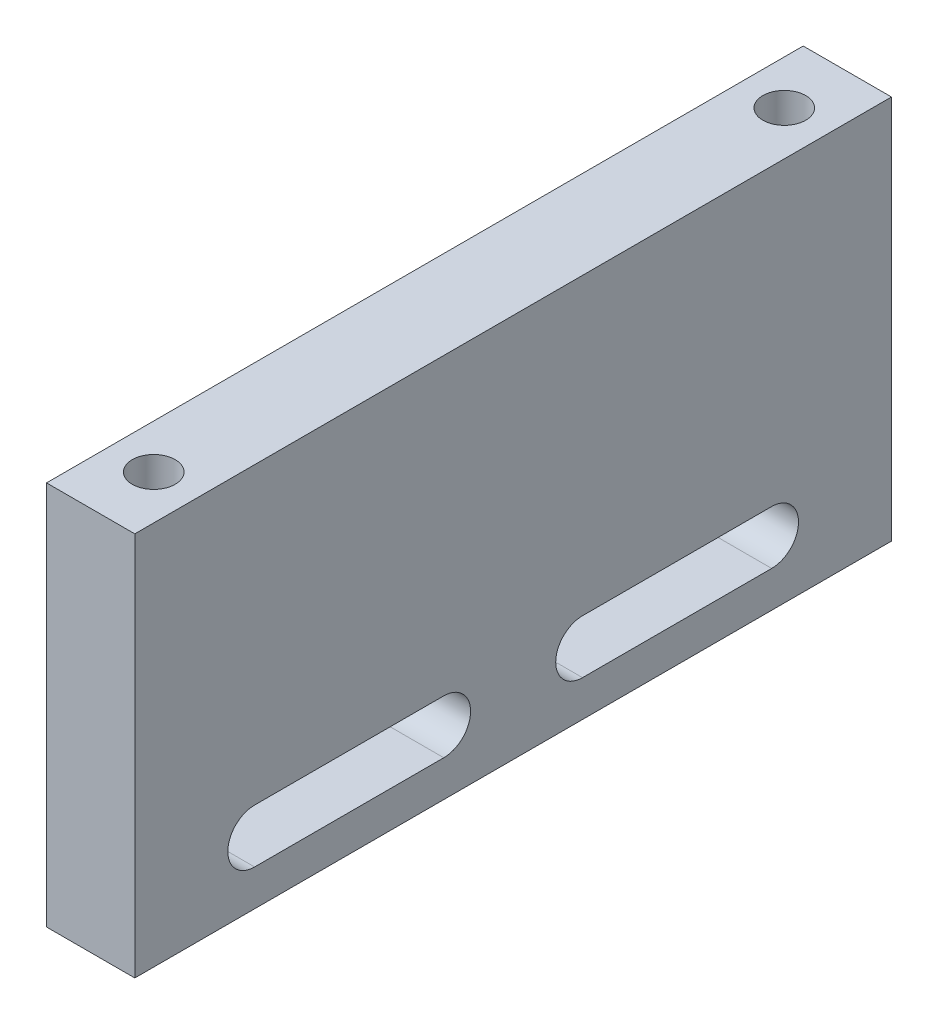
ISO-10303-21;
HEADER;
FILE_DESCRIPTION(('STEP AP214'),'2;1');
FILE_NAME('part.step','',(''),(''),'','','');
FILE_SCHEMA(('AUTOMOTIVE_DESIGN { 1 0 10303 214 1 1 1 1 }'));
ENDSEC;
DATA;
#1=APPLICATION_CONTEXT('core data for automotive mechanical design processes');
#2=APPLICATION_PROTOCOL_DEFINITION('international standard','automotive_design',2000,#1);
#3=PRODUCT_CONTEXT('',#1,'mechanical');
#4=PRODUCT('Part','Part','',(#3));
#5=PRODUCT_RELATED_PRODUCT_CATEGORY('part','',(#4));
#6=PRODUCT_DEFINITION_FORMATION('','',#4);
#7=PRODUCT_DEFINITION_CONTEXT('part definition',#1,'design');
#8=PRODUCT_DEFINITION('design','',#6,#7);
#9=PRODUCT_DEFINITION_SHAPE('','',#8);
#10=(LENGTH_UNIT() NAMED_UNIT(*) SI_UNIT(.MILLI.,.METRE.));
#11=(NAMED_UNIT(*) PLANE_ANGLE_UNIT() SI_UNIT($,.RADIAN.));
#12=(NAMED_UNIT(*) SI_UNIT($,.STERADIAN.) SOLID_ANGLE_UNIT());
#13=UNCERTAINTY_MEASURE_WITH_UNIT(LENGTH_MEASURE(1.E-05),#10,'distance_accuracy_value','');
#14=(GEOMETRIC_REPRESENTATION_CONTEXT(3) GLOBAL_UNCERTAINTY_ASSIGNED_CONTEXT((#13)) GLOBAL_UNIT_ASSIGNED_CONTEXT((#10,
#11,#12)) REPRESENTATION_CONTEXT('',''));
#15=CARTESIAN_POINT('',(0.,0.,0.));
#16=DIRECTION('',(0.,0.,1.));
#17=DIRECTION('',(1.,0.,0.));
#18=AXIS2_PLACEMENT_3D('',#15,#16,#17);
#19=CARTESIAN_POINT('',(0.,41.2499999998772,-50.));
#20=DIRECTION('',(0.,1.,0.));
#21=DIRECTION('',(0.,0.,1.));
#22=AXIS2_PLACEMENT_3D('',#19,#20,#21);
#23=CONICAL_SURFACE('',#22,3.39999999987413,1.02974425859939);
#24=CARTESIAN_POINT('',(0.,39.207073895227,-50.));
#25=VERTEX_POINT('',#24);
#26=VERTEX_LOOP('',#25);
#27=FACE_BOUND('',#26,.T.);
#28=CARTESIAN_POINT('',(0.,41.25,-50.));
#29=DIRECTION('',(0.,1.,0.));
#30=DIRECTION('',(0.,0.,1.));
#31=AXIS2_PLACEMENT_3D('',#28,#29,#30);
#32=CIRCLE('',#31,3.4);
#33=CARTESIAN_POINT('',(0.,41.25,-46.6));
#34=VERTEX_POINT('',#33);
#35=EDGE_CURVE('E149',#34,#34,#32,.T.);
#36=ORIENTED_EDGE('',*,*,#35,.T.);
#37=EDGE_LOOP('',(#36));
#38=FACE_BOUND('',#37,.T.);
#39=ADVANCED_FACE('F17',(#27,#38),#23,.F.);
#40=CARTESIAN_POINT('',(0.,41.2499999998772,50.));
#41=DIRECTION('',(0.,1.,0.));
#42=DIRECTION('',(0.,0.,1.));
#43=AXIS2_PLACEMENT_3D('',#40,#41,#42);
#44=CONICAL_SURFACE('',#43,3.39999999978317,1.02974425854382);
#45=CARTESIAN_POINT('',(0.,39.2070738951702,50.));
#46=VERTEX_POINT('',#45);
#47=VERTEX_LOOP('',#46);
#48=FACE_BOUND('',#47,.T.);
#49=CARTESIAN_POINT('',(0.,41.25,50.));
#50=DIRECTION('',(0.,1.,0.));
#51=DIRECTION('',(0.,0.,1.));
#52=AXIS2_PLACEMENT_3D('',#49,#50,#51);
#53=CIRCLE('',#52,3.4);
#54=CARTESIAN_POINT('',(0.,41.25,53.4));
#55=VERTEX_POINT('',#54);
#56=EDGE_CURVE('E120',#55,#55,#53,.T.);
#57=ORIENTED_EDGE('',*,*,#56,.T.);
#58=EDGE_LOOP('',(#57));
#59=FACE_BOUND('',#58,.T.);
#60=ADVANCED_FACE('F296',(#48,#59),#44,.F.);
#61=CARTESIAN_POINT('',(0.,61.,-50.));
#62=DIRECTION('',(0.,1.,0.));
#63=DIRECTION('',(0.,0.,1.));
#64=AXIS2_PLACEMENT_3D('',#61,#62,#63);
#65=CYLINDRICAL_SURFACE('',#64,3.4);
#66=CARTESIAN_POINT('',(0.,61.,-50.));
#67=DIRECTION('',(0.,1.,0.));
#68=DIRECTION('',(0.,0.,1.));
#69=AXIS2_PLACEMENT_3D('',#66,#67,#68);
#70=CIRCLE('',#69,3.4);
#71=CARTESIAN_POINT('',(0.,61.,-46.6));
#72=VERTEX_POINT('',#71);
#73=EDGE_CURVE('E170',#72,#72,#70,.F.);
#74=ORIENTED_EDGE('',*,*,#73,.F.);
#75=EDGE_LOOP('',(#74));
#76=FACE_BOUND('',#75,.T.);
#77=ORIENTED_EDGE('',*,*,#35,.F.);
#78=EDGE_LOOP('',(#77));
#79=FACE_BOUND('',#78,.T.);
#80=ADVANCED_FACE('F293',(#76,#79),#65,.F.);
#81=CARTESIAN_POINT('',(0.,61.,50.));
#82=DIRECTION('',(0.,1.,0.));
#83=DIRECTION('',(0.,0.,1.));
#84=AXIS2_PLACEMENT_3D('',#81,#82,#83);
#85=CYLINDRICAL_SURFACE('',#84,3.4);
#86=CARTESIAN_POINT('',(0.,61.,50.));
#87=DIRECTION('',(0.,1.,0.));
#88=DIRECTION('',(0.,0.,1.));
#89=AXIS2_PLACEMENT_3D('',#86,#87,#88);
#90=CIRCLE('',#89,3.4);
#91=CARTESIAN_POINT('',(0.,61.,53.4));
#92=VERTEX_POINT('',#91);
#93=EDGE_CURVE('E166',#92,#92,#90,.F.);
#94=ORIENTED_EDGE('',*,*,#93,.F.);
#95=EDGE_LOOP('',(#94));
#96=FACE_BOUND('',#95,.T.);
#97=ORIENTED_EDGE('',*,*,#56,.F.);
#98=EDGE_LOOP('',(#97));
#99=FACE_BOUND('',#98,.T.);
#100=ADVANCED_FACE('F289',(#96,#99),#85,.F.);
#101=CARTESIAN_POINT('',(-7.00000000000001,61.,-60.));
#102=DIRECTION('',(1.,0.,0.));
#103=DIRECTION('',(0.,0.,-1.));
#104=AXIS2_PLACEMENT_3D('',#101,#102,#103);
#105=PLANE('',#104);
#106=DIRECTION('',(0.,1.,0.));
#107=VECTOR('',#106,1.);
#108=CARTESIAN_POINT('',(-6.99999999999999,61.,60.));
#109=LINE('',#108,#107);
#110=CARTESIAN_POINT('',(-7.,0.,60.));
#111=VERTEX_POINT('',#110);
#112=CARTESIAN_POINT('',(-7.,61.,60.));
#113=VERTEX_POINT('',#112);
#114=EDGE_CURVE('E173',#111,#113,#109,.T.);
#115=ORIENTED_EDGE('',*,*,#114,.T.);
#116=DIRECTION('',(0.,0.,1.));
#117=VECTOR('',#116,1.);
#118=CARTESIAN_POINT('',(-7.00000000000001,61.,0.));
#119=LINE('',#118,#117);
#120=CARTESIAN_POINT('',(-7.00000000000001,61.,-60.));
#121=VERTEX_POINT('',#120);
#122=EDGE_CURVE('E169',#121,#113,#119,.T.);
#123=ORIENTED_EDGE('',*,*,#122,.F.);
#124=DIRECTION('',(0.,1.,0.));
#125=VECTOR('',#124,1.);
#126=CARTESIAN_POINT('',(-7.00000000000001,61.,-60.));
#127=LINE('',#126,#125);
#128=CARTESIAN_POINT('',(-7.00000000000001,0.,-60.));
#129=VERTEX_POINT('',#128);
#130=EDGE_CURVE('E200',#121,#129,#127,.F.);
#131=ORIENTED_EDGE('',*,*,#130,.T.);
#132=DIRECTION('',(0.,0.,1.));
#133=VECTOR('',#132,1.);
#134=CARTESIAN_POINT('',(-7.00000000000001,0.,0.));
#135=LINE('',#134,#133);
#136=EDGE_CURVE('E196',#129,#111,#135,.T.);
#137=ORIENTED_EDGE('',*,*,#136,.T.);
#138=EDGE_LOOP('',(#115,#123,#131,#137));
#139=FACE_BOUND('',#138,.T.);
#140=CARTESIAN_POINT('',(-7.00000000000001,10.,41.));
#141=DIRECTION('',(1.,0.,0.));
#142=DIRECTION('',(0.,0.,-1.));
#143=AXIS2_PLACEMENT_3D('',#140,#141,#142);
#144=CIRCLE('',#143,4.25000000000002);
#145=CARTESIAN_POINT('',(-7.00000000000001,14.25,41.));
#146=VERTEX_POINT('',#145);
#147=CARTESIAN_POINT('',(-7.00000000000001,5.74999999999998,41.));
#148=VERTEX_POINT('',#147);
#149=EDGE_CURVE('E174',#146,#148,#144,.T.);
#150=ORIENTED_EDGE('',*,*,#149,.T.);
#151=DIRECTION('',(0.,0.,-1.));
#152=VECTOR('',#151,1.);
#153=CARTESIAN_POINT('',(-7.00000000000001,5.74999999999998,41.));
#154=LINE('',#153,#152);
#155=CARTESIAN_POINT('',(-7.,5.74999999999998,11.));
#156=VERTEX_POINT('',#155);
#157=EDGE_CURVE('E135',#148,#156,#154,.T.);
#158=ORIENTED_EDGE('',*,*,#157,.T.);
#159=CARTESIAN_POINT('',(-7.00000000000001,10.,11.));
#160=DIRECTION('',(1.,0.,0.));
#161=DIRECTION('',(0.,0.,-1.));
#162=AXIS2_PLACEMENT_3D('',#159,#160,#161);
#163=CIRCLE('',#162,4.25000000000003);
#164=CARTESIAN_POINT('',(-7.00000000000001,14.25,11.));
#165=VERTEX_POINT('',#164);
#166=EDGE_CURVE('E176',#156,#165,#163,.T.);
#167=ORIENTED_EDGE('',*,*,#166,.T.);
#168=DIRECTION('',(0.,0.,1.));
#169=VECTOR('',#168,1.);
#170=CARTESIAN_POINT('',(-7.00000000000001,14.25,41.));
#171=LINE('',#170,#169);
#172=EDGE_CURVE('E140',#165,#146,#171,.T.);
#173=ORIENTED_EDGE('',*,*,#172,.T.);
#174=EDGE_LOOP('',(#150,#158,#167,#173));
#175=FACE_BOUND('',#174,.T.);
#176=CARTESIAN_POINT('',(-7.00000000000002,10.,-11.));
#177=DIRECTION('',(1.,0.,0.));
#178=DIRECTION('',(0.,0.,-1.));
#179=AXIS2_PLACEMENT_3D('',#176,#177,#178);
#180=CIRCLE('',#179,4.25000000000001);
#181=CARTESIAN_POINT('',(-7.00000000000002,14.25,-11.));
#182=VERTEX_POINT('',#181);
#183=CARTESIAN_POINT('',(-7.00000000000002,5.74999999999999,-11.));
#184=VERTEX_POINT('',#183);
#185=EDGE_CURVE('E177',#182,#184,#180,.T.);
#186=ORIENTED_EDGE('',*,*,#185,.T.);
#187=DIRECTION('',(0.,0.,-1.));
#188=VECTOR('',#187,1.);
#189=CARTESIAN_POINT('',(-7.00000000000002,5.74999999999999,-11.));
#190=LINE('',#189,#188);
#191=CARTESIAN_POINT('',(-7.00000000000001,5.74999999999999,-41.));
#192=VERTEX_POINT('',#191);
#193=EDGE_CURVE('E114',#184,#192,#190,.T.);
#194=ORIENTED_EDGE('',*,*,#193,.T.);
#195=CARTESIAN_POINT('',(-7.00000000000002,10.,-41.));
#196=DIRECTION('',(1.,0.,0.));
#197=DIRECTION('',(0.,0.,-1.));
#198=AXIS2_PLACEMENT_3D('',#195,#196,#197);
#199=CIRCLE('',#198,4.25000000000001);
#200=CARTESIAN_POINT('',(-7.00000000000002,14.25,-41.));
#201=VERTEX_POINT('',#200);
#202=EDGE_CURVE('E20',#192,#201,#199,.T.);
#203=ORIENTED_EDGE('',*,*,#202,.T.);
#204=DIRECTION('',(0.,0.,1.));
#205=VECTOR('',#204,1.);
#206=CARTESIAN_POINT('',(-7.00000000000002,14.25,-11.));
#207=LINE('',#206,#205);
#208=EDGE_CURVE('E111',#201,#182,#207,.T.);
#209=ORIENTED_EDGE('',*,*,#208,.T.);
#210=EDGE_LOOP('',(#186,#194,#203,#209));
#211=FACE_BOUND('',#210,.T.);
#212=ADVANCED_FACE('F110',(#139,#175,#211),#105,.F.);
#213=CARTESIAN_POINT('',(-7.00000000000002,10.,-41.));
#214=DIRECTION('',(1.,0.,0.));
#215=DIRECTION('',(0.,0.,-1.));
#216=AXIS2_PLACEMENT_3D('',#213,#214,#215);
#217=CYLINDRICAL_SURFACE('',#216,4.25000000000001);
#218=ORIENTED_EDGE('',*,*,#202,.F.);
#219=DIRECTION('',(1.,0.,0.));
#220=VECTOR('',#219,1.);
#221=CARTESIAN_POINT('',(-7.00000000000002,5.74999999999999,-41.));
#222=LINE('',#221,#220);
#223=CARTESIAN_POINT('',(7.,5.74999999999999,-41.));
#224=VERTEX_POINT('',#223);
#225=EDGE_CURVE('E144',#192,#224,#222,.T.);
#226=ORIENTED_EDGE('',*,*,#225,.T.);
#227=CARTESIAN_POINT('',(6.99999999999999,10.,-41.));
#228=DIRECTION('',(1.,0.,0.));
#229=DIRECTION('',(0.,0.,-1.));
#230=AXIS2_PLACEMENT_3D('',#227,#228,#229);
#231=CIRCLE('',#230,4.25000000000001);
#232=CARTESIAN_POINT('',(7.,14.25,-41.));
#233=VERTEX_POINT('',#232);
#234=EDGE_CURVE('E130',#224,#233,#231,.T.);
#235=ORIENTED_EDGE('',*,*,#234,.T.);
#236=DIRECTION('',(1.,0.,0.));
#237=VECTOR('',#236,1.);
#238=CARTESIAN_POINT('',(-7.00000000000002,14.25,-41.));
#239=LINE('',#238,#237);
#240=EDGE_CURVE('E119',#233,#201,#239,.F.);
#241=ORIENTED_EDGE('',*,*,#240,.T.);
#242=EDGE_LOOP('',(#218,#226,#235,#241));
#243=FACE_BOUND('',#242,.T.);
#244=ADVANCED_FACE('F129',(#243),#217,.F.);
#245=CARTESIAN_POINT('',(-7.00000000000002,14.25,-11.));
#246=DIRECTION('',(0.,1.,0.));
#247=DIRECTION('',(0.,0.,1.));
#248=AXIS2_PLACEMENT_3D('',#245,#246,#247);
#249=PLANE('',#248);
#250=DIRECTION('',(1.,0.,0.));
#251=VECTOR('',#250,1.);
#252=CARTESIAN_POINT('',(-7.00000000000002,14.25,-11.));
#253=LINE('',#252,#251);
#254=CARTESIAN_POINT('',(7.,14.25,-11.));
#255=VERTEX_POINT('',#254);
#256=EDGE_CURVE('E127',#255,#182,#253,.F.);
#257=ORIENTED_EDGE('',*,*,#256,.T.);
#258=ORIENTED_EDGE('',*,*,#208,.F.);
#259=ORIENTED_EDGE('',*,*,#240,.F.);
#260=DIRECTION('',(0.,0.,1.));
#261=VECTOR('',#260,1.);
#262=CARTESIAN_POINT('',(6.99999999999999,14.25,-60.));
#263=LINE('',#262,#261);
#264=EDGE_CURVE('E163',#233,#255,#263,.T.);
#265=ORIENTED_EDGE('',*,*,#264,.T.);
#266=EDGE_LOOP('',(#257,#258,#259,#265));
#267=FACE_BOUND('',#266,.T.);
#268=ADVANCED_FACE('F124',(#267),#249,.F.);
#269=CARTESIAN_POINT('',(-7.00000000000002,10.,-11.));
#270=DIRECTION('',(1.,0.,0.));
#271=DIRECTION('',(0.,0.,-1.));
#272=AXIS2_PLACEMENT_3D('',#269,#270,#271);
#273=CYLINDRICAL_SURFACE('',#272,4.25000000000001);
#274=DIRECTION('',(1.,0.,0.));
#275=VECTOR('',#274,1.);
#276=CARTESIAN_POINT('',(-7.00000000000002,5.74999999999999,-11.));
#277=LINE('',#276,#275);
#278=CARTESIAN_POINT('',(7.,5.74999999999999,-11.));
#279=VERTEX_POINT('',#278);
#280=EDGE_CURVE('E145',#279,#184,#277,.F.);
#281=ORIENTED_EDGE('',*,*,#280,.T.);
#282=ORIENTED_EDGE('',*,*,#185,.F.);
#283=ORIENTED_EDGE('',*,*,#256,.F.);
#284=CARTESIAN_POINT('',(7.,10.,-11.));
#285=DIRECTION('',(1.,0.,0.));
#286=DIRECTION('',(0.,0.,-1.));
#287=AXIS2_PLACEMENT_3D('',#284,#285,#286);
#288=CIRCLE('',#287,4.25000000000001);
#289=EDGE_CURVE('E160',#255,#279,#288,.T.);
#290=ORIENTED_EDGE('',*,*,#289,.T.);
#291=EDGE_LOOP('',(#281,#282,#283,#290));
#292=FACE_BOUND('',#291,.T.);
#293=ADVANCED_FACE('F280',(#292),#273,.F.);
#294=CARTESIAN_POINT('',(-7.00000000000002,5.74999999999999,-11.));
#295=DIRECTION('',(0.,-1.,0.));
#296=DIRECTION('',(0.,0.,-1.));
#297=AXIS2_PLACEMENT_3D('',#294,#295,#296);
#298=PLANE('',#297);
#299=ORIENTED_EDGE('',*,*,#225,.F.);
#300=ORIENTED_EDGE('',*,*,#193,.F.);
#301=ORIENTED_EDGE('',*,*,#280,.F.);
#302=DIRECTION('',(0.,0.,1.));
#303=VECTOR('',#302,1.);
#304=CARTESIAN_POINT('',(6.99999999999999,5.74999999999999,-60.));
#305=LINE('',#304,#303);
#306=EDGE_CURVE('E159',#279,#224,#305,.F.);
#307=ORIENTED_EDGE('',*,*,#306,.T.);
#308=EDGE_LOOP('',(#299,#300,#301,#307));
#309=FACE_BOUND('',#308,.T.);
#310=ADVANCED_FACE('F186',(#309),#298,.F.);
#311=CARTESIAN_POINT('',(-7.00000000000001,10.,11.));
#312=DIRECTION('',(1.,0.,0.));
#313=DIRECTION('',(0.,0.,-1.));
#314=AXIS2_PLACEMENT_3D('',#311,#312,#313);
#315=CYLINDRICAL_SURFACE('',#314,4.25000000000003);
#316=ORIENTED_EDGE('',*,*,#166,.F.);
#317=DIRECTION('',(1.,0.,0.));
#318=VECTOR('',#317,1.);
#319=CARTESIAN_POINT('',(-7.00000000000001,5.74999999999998,11.));
#320=LINE('',#319,#318);
#321=CARTESIAN_POINT('',(7.,5.74999999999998,11.));
#322=VERTEX_POINT('',#321);
#323=EDGE_CURVE('E138',#156,#322,#320,.T.);
#324=ORIENTED_EDGE('',*,*,#323,.T.);
#325=CARTESIAN_POINT('',(7.,10.,11.));
#326=DIRECTION('',(1.,0.,0.));
#327=DIRECTION('',(0.,0.,-1.));
#328=AXIS2_PLACEMENT_3D('',#325,#326,#327);
#329=CIRCLE('',#328,4.25000000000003);
#330=CARTESIAN_POINT('',(7.,14.25,11.));
#331=VERTEX_POINT('',#330);
#332=EDGE_CURVE('E157',#322,#331,#329,.T.);
#333=ORIENTED_EDGE('',*,*,#332,.T.);
#334=DIRECTION('',(1.,0.,0.));
#335=VECTOR('',#334,1.);
#336=CARTESIAN_POINT('',(-7.00000000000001,14.25,11.));
#337=LINE('',#336,#335);
#338=EDGE_CURVE('E143',#331,#165,#337,.F.);
#339=ORIENTED_EDGE('',*,*,#338,.T.);
#340=EDGE_LOOP('',(#316,#324,#333,#339));
#341=FACE_BOUND('',#340,.T.);
#342=ADVANCED_FACE('F274',(#341),#315,.F.);
#343=CARTESIAN_POINT('',(-7.00000000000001,14.25,41.));
#344=DIRECTION('',(0.,1.,0.));
#345=DIRECTION('',(0.,0.,1.));
#346=AXIS2_PLACEMENT_3D('',#343,#344,#345);
#347=PLANE('',#346);
#348=DIRECTION('',(1.,0.,0.));
#349=VECTOR('',#348,1.);
#350=CARTESIAN_POINT('',(-7.00000000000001,14.25,41.));
#351=LINE('',#350,#349);
#352=CARTESIAN_POINT('',(7.,14.25,41.));
#353=VERTEX_POINT('',#352);
#354=EDGE_CURVE('E142',#353,#146,#351,.F.);
#355=ORIENTED_EDGE('',*,*,#354,.T.);
#356=ORIENTED_EDGE('',*,*,#172,.F.);
#357=ORIENTED_EDGE('',*,*,#338,.F.);
#358=DIRECTION('',(0.,0.,1.));
#359=VECTOR('',#358,1.);
#360=CARTESIAN_POINT('',(6.99999999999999,14.25,-60.));
#361=LINE('',#360,#359);
#362=EDGE_CURVE('E156',#331,#353,#361,.T.);
#363=ORIENTED_EDGE('',*,*,#362,.T.);
#364=EDGE_LOOP('',(#355,#356,#357,#363));
#365=FACE_BOUND('',#364,.T.);
#366=ADVANCED_FACE('F217',(#365),#347,.F.);
#367=CARTESIAN_POINT('',(-7.00000000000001,10.,41.));
#368=DIRECTION('',(1.,0.,0.));
#369=DIRECTION('',(0.,0.,-1.));
#370=AXIS2_PLACEMENT_3D('',#367,#368,#369);
#371=CYLINDRICAL_SURFACE('',#370,4.25000000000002);
#372=DIRECTION('',(1.,0.,0.));
#373=VECTOR('',#372,1.);
#374=CARTESIAN_POINT('',(-7.00000000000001,5.74999999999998,41.));
#375=LINE('',#374,#373);
#376=CARTESIAN_POINT('',(7.00000000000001,5.74999999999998,41.));
#377=VERTEX_POINT('',#376);
#378=EDGE_CURVE('E139',#377,#148,#375,.F.);
#379=ORIENTED_EDGE('',*,*,#378,.T.);
#380=ORIENTED_EDGE('',*,*,#149,.F.);
#381=ORIENTED_EDGE('',*,*,#354,.F.);
#382=CARTESIAN_POINT('',(7.,10.,41.));
#383=DIRECTION('',(1.,0.,0.));
#384=DIRECTION('',(0.,0.,-1.));
#385=AXIS2_PLACEMENT_3D('',#382,#383,#384);
#386=CIRCLE('',#385,4.25000000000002);
#387=EDGE_CURVE('E152',#353,#377,#386,.T.);
#388=ORIENTED_EDGE('',*,*,#387,.T.);
#389=EDGE_LOOP('',(#379,#380,#381,#388));
#390=FACE_BOUND('',#389,.T.);
#391=ADVANCED_FACE('F224',(#390),#371,.F.);
#392=CARTESIAN_POINT('',(-7.00000000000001,5.74999999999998,41.));
#393=DIRECTION('',(0.,-1.,0.));
#394=DIRECTION('',(0.,0.,-1.));
#395=AXIS2_PLACEMENT_3D('',#392,#393,#394);
#396=PLANE('',#395);
#397=ORIENTED_EDGE('',*,*,#323,.F.);
#398=ORIENTED_EDGE('',*,*,#157,.F.);
#399=ORIENTED_EDGE('',*,*,#378,.F.);
#400=DIRECTION('',(0.,0.,1.));
#401=VECTOR('',#400,1.);
#402=CARTESIAN_POINT('',(6.99999999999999,5.74999999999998,-60.));
#403=LINE('',#402,#401);
#404=EDGE_CURVE('E155',#377,#322,#403,.F.);
#405=ORIENTED_EDGE('',*,*,#404,.T.);
#406=EDGE_LOOP('',(#397,#398,#399,#405));
#407=FACE_BOUND('',#406,.T.);
#408=ADVANCED_FACE('F267',(#407),#396,.F.);
#409=CARTESIAN_POINT('',(-6.99999999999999,61.,60.));
#410=DIRECTION('',(0.,0.,-1.));
#411=DIRECTION('',(-1.,0.,0.));
#412=AXIS2_PLACEMENT_3D('',#409,#410,#411);
#413=PLANE('',#412);
#414=DIRECTION('',(0.,1.,0.));
#415=VECTOR('',#414,1.);
#416=CARTESIAN_POINT('',(7.00000000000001,61.,60.));
#417=LINE('',#416,#415);
#418=CARTESIAN_POINT('',(7.00000000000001,0.,60.));
#419=VERTEX_POINT('',#418);
#420=CARTESIAN_POINT('',(7.00000000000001,61.,60.));
#421=VERTEX_POINT('',#420);
#422=EDGE_CURVE('E231',#419,#421,#417,.T.);
#423=ORIENTED_EDGE('',*,*,#422,.T.);
#424=DIRECTION('',(1.,0.,0.));
#425=VECTOR('',#424,1.);
#426=CARTESIAN_POINT('',(0.,61.,60.));
#427=LINE('',#426,#425);
#428=EDGE_CURVE('E205',#113,#421,#427,.T.);
#429=ORIENTED_EDGE('',*,*,#428,.F.);
#430=ORIENTED_EDGE('',*,*,#114,.F.);
#431=DIRECTION('',(1.,0.,0.));
#432=VECTOR('',#431,1.);
#433=CARTESIAN_POINT('',(0.,0.,60.));
#434=LINE('',#433,#432);
#435=EDGE_CURVE('E165',#111,#419,#434,.T.);
#436=ORIENTED_EDGE('',*,*,#435,.T.);
#437=EDGE_LOOP('',(#423,#429,#430,#436));
#438=FACE_BOUND('',#437,.T.);
#439=ADVANCED_FACE('F250',(#438),#413,.F.);
#440=CARTESIAN_POINT('',(0.,61.,0.));
#441=DIRECTION('',(0.,1.,0.));
#442=DIRECTION('',(0.,0.,1.));
#443=AXIS2_PLACEMENT_3D('',#440,#441,#442);
#444=PLANE('',#443);
#445=ORIENTED_EDGE('',*,*,#122,.T.);
#446=ORIENTED_EDGE('',*,*,#428,.T.);
#447=DIRECTION('',(0.,0.,1.));
#448=VECTOR('',#447,1.);
#449=CARTESIAN_POINT('',(6.99999999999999,61.,-60.));
#450=LINE('',#449,#448);
#451=CARTESIAN_POINT('',(7.,61.,-60.));
#452=VERTEX_POINT('',#451);
#453=EDGE_CURVE('E233',#421,#452,#450,.F.);
#454=ORIENTED_EDGE('',*,*,#453,.T.);
#455=DIRECTION('',(1.,0.,0.));
#456=VECTOR('',#455,1.);
#457=CARTESIAN_POINT('',(-7.00000000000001,61.,-60.));
#458=LINE('',#457,#456);
#459=EDGE_CURVE('E202',#452,#121,#458,.F.);
#460=ORIENTED_EDGE('',*,*,#459,.T.);
#461=EDGE_LOOP('',(#445,#446,#454,#460));
#462=FACE_BOUND('',#461,.T.);
#463=ORIENTED_EDGE('',*,*,#93,.T.);
#464=EDGE_LOOP('',(#463));
#465=FACE_BOUND('',#464,.T.);
#466=ORIENTED_EDGE('',*,*,#73,.T.);
#467=EDGE_LOOP('',(#466));
#468=FACE_BOUND('',#467,.T.);
#469=ADVANCED_FACE('F246',(#462,#465,#468),#444,.T.);
#470=CARTESIAN_POINT('',(-7.00000000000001,61.,-60.));
#471=DIRECTION('',(0.,0.,1.));
#472=DIRECTION('',(1.,0.,0.));
#473=AXIS2_PLACEMENT_3D('',#470,#471,#472);
#474=PLANE('',#473);
#475=ORIENTED_EDGE('',*,*,#130,.F.);
#476=ORIENTED_EDGE('',*,*,#459,.F.);
#477=DIRECTION('',(0.,1.,0.));
#478=VECTOR('',#477,1.);
#479=CARTESIAN_POINT('',(6.99999999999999,61.,-60.));
#480=LINE('',#479,#478);
#481=CARTESIAN_POINT('',(7.,0.,-60.));
#482=VERTEX_POINT('',#481);
#483=EDGE_CURVE('E26',#452,#482,#480,.F.);
#484=ORIENTED_EDGE('',*,*,#483,.T.);
#485=DIRECTION('',(1.,0.,0.));
#486=VECTOR('',#485,1.);
#487=CARTESIAN_POINT('',(0.,0.,-60.));
#488=LINE('',#487,#486);
#489=EDGE_CURVE('E34',#482,#129,#488,.F.);
#490=ORIENTED_EDGE('',*,*,#489,.T.);
#491=EDGE_LOOP('',(#475,#476,#484,#490));
#492=FACE_BOUND('',#491,.T.);
#493=ADVANCED_FACE('F242',(#492),#474,.F.);
#494=CARTESIAN_POINT('',(0.,0.,0.));
#495=DIRECTION('',(0.,1.,0.));
#496=DIRECTION('',(0.,0.,1.));
#497=AXIS2_PLACEMENT_3D('',#494,#495,#496);
#498=PLANE('',#497);
#499=ORIENTED_EDGE('',*,*,#435,.F.);
#500=ORIENTED_EDGE('',*,*,#136,.F.);
#501=ORIENTED_EDGE('',*,*,#489,.F.);
#502=DIRECTION('',(0.,0.,1.));
#503=VECTOR('',#502,1.);
#504=CARTESIAN_POINT('',(6.99999999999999,0.,-60.));
#505=LINE('',#504,#503);
#506=EDGE_CURVE('E11',#482,#419,#505,.T.);
#507=ORIENTED_EDGE('',*,*,#506,.T.);
#508=EDGE_LOOP('',(#499,#500,#501,#507));
#509=FACE_BOUND('',#508,.T.);
#510=ADVANCED_FACE('F252',(#509),#498,.F.);
#511=CARTESIAN_POINT('',(6.99999999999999,61.,-60.));
#512=DIRECTION('',(-1.,0.,0.));
#513=DIRECTION('',(0.,0.,1.));
#514=AXIS2_PLACEMENT_3D('',#511,#512,#513);
#515=PLANE('',#514);
#516=ORIENTED_EDGE('',*,*,#483,.F.);
#517=ORIENTED_EDGE('',*,*,#453,.F.);
#518=ORIENTED_EDGE('',*,*,#422,.F.);
#519=ORIENTED_EDGE('',*,*,#506,.F.);
#520=EDGE_LOOP('',(#516,#517,#518,#519));
#521=FACE_BOUND('',#520,.T.);
#522=ORIENTED_EDGE('',*,*,#387,.F.);
#523=ORIENTED_EDGE('',*,*,#362,.F.);
#524=ORIENTED_EDGE('',*,*,#332,.F.);
#525=ORIENTED_EDGE('',*,*,#404,.F.);
#526=EDGE_LOOP('',(#522,#523,#524,#525));
#527=FACE_BOUND('',#526,.T.);
#528=ORIENTED_EDGE('',*,*,#289,.F.);
#529=ORIENTED_EDGE('',*,*,#264,.F.);
#530=ORIENTED_EDGE('',*,*,#234,.F.);
#531=ORIENTED_EDGE('',*,*,#306,.F.);
#532=EDGE_LOOP('',(#528,#529,#530,#531));
#533=FACE_BOUND('',#532,.T.);
#534=ADVANCED_FACE('F227',(#521,#527,#533),#515,.F.);
#535=CLOSED_SHELL('',(#39,#60,#80,#100,#212,#244,#268,#293,#310,#342,#366,#391,#408,#439,#469,
#493,#510,#534));
#536=MANIFOLD_SOLID_BREP('B1',#535);
#537=ADVANCED_BREP_SHAPE_REPRESENTATION('',(#18,#536),#14);
#538=SHAPE_DEFINITION_REPRESENTATION(#9,#537);
ENDSEC;
END-ISO-10303-21;
